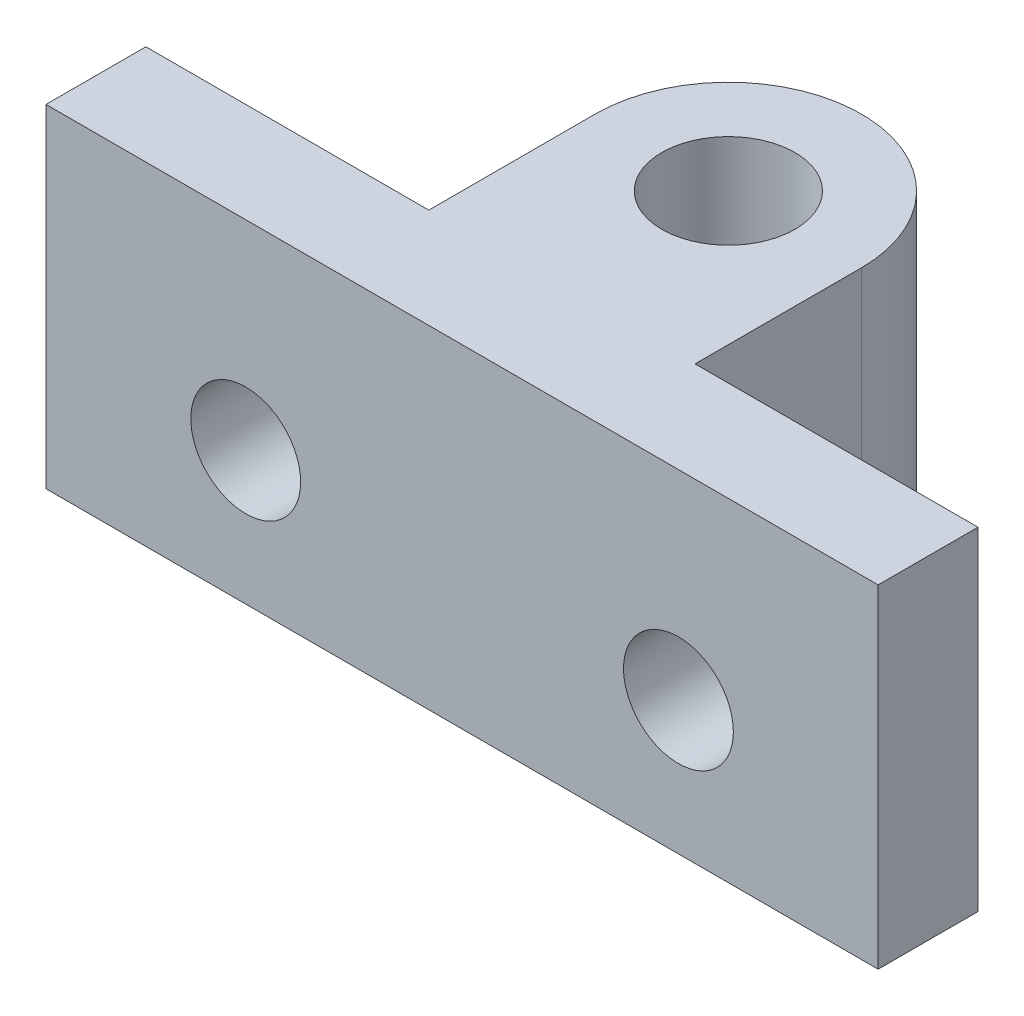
from build123d import *

# Parameters (mm, degrees)
SKETCH_2_R              = 2
EXTRUDE_1_DEPTH         = 10
HOLE_WIZARD_3_3_3_3_1_D = 3.3


with BuildPart() as part:
    # Sketch 2 → Extrude 1 (new body)
    with BuildSketch(Plane(origin=(0, 0, 0), x_dir=(1, 0, 0), z_dir=(0, 1, 0))):
        with BuildLine():
            Line((16.5, 3), (16.5, 8))
            ThreePointArc((16.5, 8), (12.5, 12), (8.5, 8))
            Line((8.5, 8), (8.5, 3))
            Line((8.5, 3), (0, 3))
            Line((0, 3), (0, 0))
            Line((0, 0), (25, 0))
            Line((25, 0), (25, 3))
            Line((25, 3), (16.5, 3))
        make_face()
        with Locations(Location((12.5, 8, 0), (0, 0, 270))):
            Circle(SKETCH_2_R, mode=Mode.SUBTRACT)
    extrude(amount=EXTRUDE_1_DEPTH)

    # Hole Wizard 3.3 _3.3_ _1 (through all)
    with Locations(Plane.XY):
        with Locations((5.999999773, 4.000000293), (18.999999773, 4.000000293)):
            Hole(HOLE_WIZARD_3_3_3_3_1_D / 2)


solid = part.part
